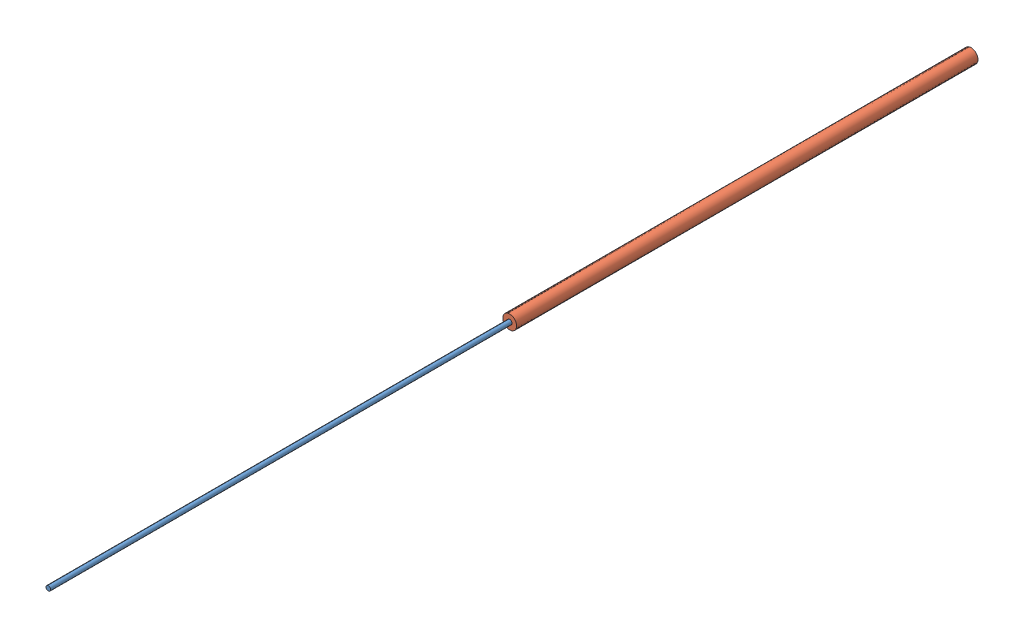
SolidWorks assembly Zwei Kabel .SLDASM, configuration Standard (file format 8000). Lengths in mm.
Overall size (1.5 1.5 100).
2 component instances, 2 part files, 0 mates.
Components (placement in the parent):
- Kabel 01-1: Kabel 01.SLDPRT [Standard] at origin size (0.5 0.5 50)
- Kabel 02-1: Kabel 02.SLDPRT [Standard] at origin size (1.5 1.5 50)
